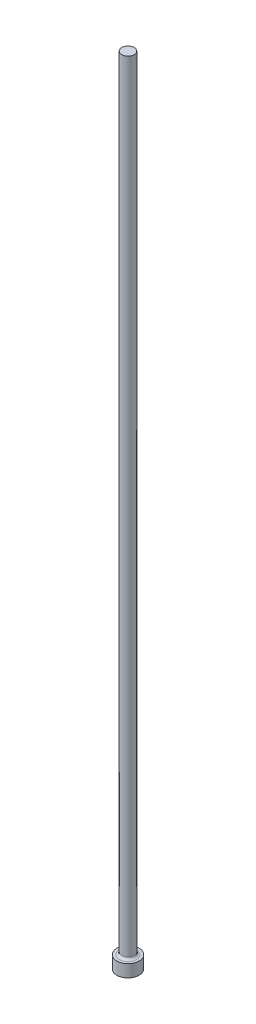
from build123d import *


with BuildPart() as part:
    # Sketch1 → Revolve1 (revolve)
    with BuildSketch(Plane.XY, mode=Mode.PRIVATE) as revolve1_sk:
        with BuildLine():
            Line((0, 0), (3.556, 0))
            Line((3.556, 0), (3.556, 3.9624))
            Line((3.556, 3.9624), (2.74574, 3.9624))
            ThreePointArc((2.74574, 3.9624), (2.206924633, 4.185584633), (1.98374, 4.7244))
            Line((1.98374, 4.7244), (1.98374, 254))
            Line((1.98374, 254), (0, 254))
            Line((0, 254), (0, 0))
        make_face()
    revolve(revolve1_sk.sketch.rotate(Axis((0, 254, 0), (0, -1, 0)), 180), axis=Axis((0, 254, 0), (0, -1, 0)))


solid = part.part
